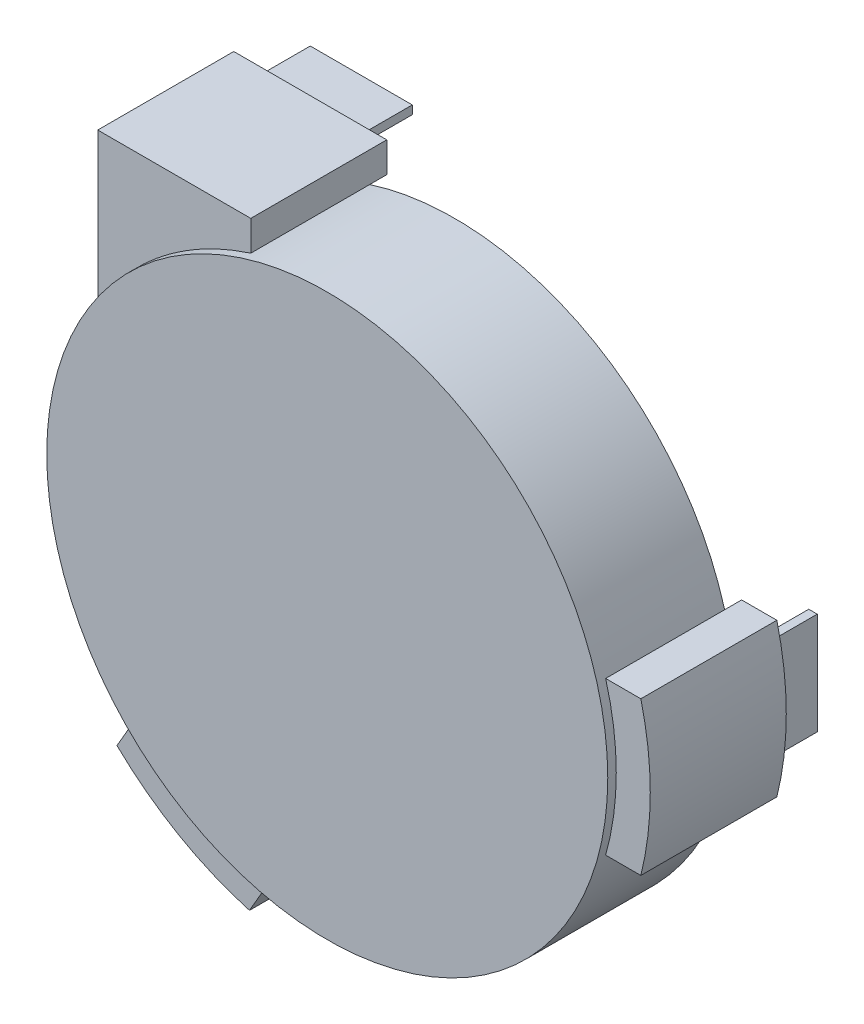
ISO-10303-21;
HEADER;
FILE_DESCRIPTION(('STEP AP214'),'2;1');
FILE_NAME('part.step','',(''),(''),'','','');
FILE_SCHEMA(('AUTOMOTIVE_DESIGN { 1 0 10303 214 1 1 1 1 }'));
ENDSEC;
DATA;
#1=APPLICATION_CONTEXT('core data for automotive mechanical design processes');
#2=APPLICATION_PROTOCOL_DEFINITION('international standard','automotive_design',2000,#1);
#3=PRODUCT_CONTEXT('',#1,'mechanical');
#4=PRODUCT('Part','Part','',(#3));
#5=PRODUCT_RELATED_PRODUCT_CATEGORY('part','',(#4));
#6=PRODUCT_DEFINITION_FORMATION('','',#4);
#7=PRODUCT_DEFINITION_CONTEXT('part definition',#1,'design');
#8=PRODUCT_DEFINITION('design','',#6,#7);
#9=PRODUCT_DEFINITION_SHAPE('','',#8);
#10=(LENGTH_UNIT() NAMED_UNIT(*) SI_UNIT(.MILLI.,.METRE.));
#11=(NAMED_UNIT(*) PLANE_ANGLE_UNIT() SI_UNIT($,.RADIAN.));
#12=(NAMED_UNIT(*) SI_UNIT($,.STERADIAN.) SOLID_ANGLE_UNIT());
#13=UNCERTAINTY_MEASURE_WITH_UNIT(LENGTH_MEASURE(1.E-05),#10,'distance_accuracy_value','');
#14=(GEOMETRIC_REPRESENTATION_CONTEXT(3) GLOBAL_UNCERTAINTY_ASSIGNED_CONTEXT((#13)) GLOBAL_UNIT_ASSIGNED_CONTEXT((#10,
#11,#12)) REPRESENTATION_CONTEXT('',''));
#15=CARTESIAN_POINT('',(0.,0.,0.));
#16=DIRECTION('',(0.,0.,1.));
#17=DIRECTION('',(1.,0.,0.));
#18=AXIS2_PLACEMENT_3D('',#15,#16,#17);
#19=CARTESIAN_POINT('',(-11.8343682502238,-11.4977270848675,-1.));
#20=DIRECTION('',(-0.866025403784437,0.500000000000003,0.));
#21=DIRECTION('',(-0.500000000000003,-0.866025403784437,0.));
#22=AXIS2_PLACEMENT_3D('',#19,#20,#21);
#23=PLANE('',#22);
#24=DIRECTION('',(-0.500000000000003,-0.866025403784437,0.));
#25=VECTOR('',#24,1.);
#26=CARTESIAN_POINT('',(-11.8343682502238,-11.4977270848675,7.));
#27=LINE('',#26,#25);
#28=CARTESIAN_POINT('',(-11.8343682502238,-11.4977270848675,7.));
#29=VERTEX_POINT('',#28);
#30=CARTESIAN_POINT('',(-12.8692935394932,-13.29027026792,7.));
#31=VERTEX_POINT('',#30);
#32=EDGE_CURVE('E12',#29,#31,#27,.T.);
#33=ORIENTED_EDGE('',*,*,#32,.F.);
#34=DIRECTION('',(0.,0.,1.));
#35=VECTOR('',#34,1.);
#36=CARTESIAN_POINT('',(-11.8343682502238,-11.4977270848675,-1.));
#37=LINE('',#36,#35);
#38=CARTESIAN_POINT('',(-11.8343682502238,-11.4977270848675,-1.));
#39=VERTEX_POINT('',#38);
#40=EDGE_CURVE('E99',#39,#29,#37,.T.);
#41=ORIENTED_EDGE('',*,*,#40,.F.);
#42=DIRECTION('',(-0.500000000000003,-0.866025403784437,0.));
#43=VECTOR('',#42,1.);
#44=CARTESIAN_POINT('',(-11.8343682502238,-11.4977270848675,-1.));
#45=LINE('',#44,#43);
#46=CARTESIAN_POINT('',(-12.8692935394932,-13.29027026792,-1.));
#47=VERTEX_POINT('',#46);
#48=EDGE_CURVE('E51',#39,#47,#45,.T.);
#49=ORIENTED_EDGE('',*,*,#48,.T.);
#50=DIRECTION('',(0.,0.,1.));
#51=VECTOR('',#50,1.);
#52=CARTESIAN_POINT('',(-12.8692935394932,-13.29027026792,-1.));
#53=LINE('',#52,#51);
#54=EDGE_CURVE('E73',#47,#31,#53,.T.);
#55=ORIENTED_EDGE('',*,*,#54,.T.);
#56=EDGE_LOOP('',(#33,#41,#49,#55));
#57=FACE_BOUND('',#56,.T.);
#58=ADVANCED_FACE('F47',(#57),#23,.T.);
#59=CARTESIAN_POINT('',(0.,0.,-1.));
#60=DIRECTION('',(0.,0.,1.));
#61=DIRECTION('',(1.,0.,0.));
#62=AXIS2_PLACEMENT_3D('',#59,#60,#61);
#63=CYLINDRICAL_SURFACE('',#62,16.5);
#64=CARTESIAN_POINT('',(0.,0.,7.));
#65=DIRECTION('',(0.,0.,1.));
#66=DIRECTION('',(1.,0.,0.));
#67=AXIS2_PLACEMENT_3D('',#64,#65,#66);
#68=CIRCLE('',#67,16.5);
#69=CARTESIAN_POINT('',(-4.04013961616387,-15.9977270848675,7.));
#70=VERTEX_POINT('',#69);
#71=EDGE_CURVE('E166',#29,#70,#68,.T.);
#72=ORIENTED_EDGE('',*,*,#71,.T.);
#73=DIRECTION('',(0.,0.,1.));
#74=VECTOR('',#73,1.);
#75=CARTESIAN_POINT('',(-4.04013961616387,-15.9977270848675,-1.));
#76=LINE('',#75,#74);
#77=CARTESIAN_POINT('',(-4.04013961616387,-15.9977270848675,-1.));
#78=VERTEX_POINT('',#77);
#79=EDGE_CURVE('E162',#78,#70,#76,.T.);
#80=ORIENTED_EDGE('',*,*,#79,.F.);
#81=CARTESIAN_POINT('',(0.,0.,-1.));
#82=DIRECTION('',(0.,0.,1.));
#83=DIRECTION('',(1.,0.,0.));
#84=AXIS2_PLACEMENT_3D('',#81,#82,#83);
#85=CIRCLE('',#84,16.5);
#86=EDGE_CURVE('E159',#39,#78,#85,.T.);
#87=ORIENTED_EDGE('',*,*,#86,.F.);
#88=ORIENTED_EDGE('',*,*,#40,.T.);
#89=EDGE_LOOP('',(#72,#80,#87,#88));
#90=FACE_BOUND('',#89,.T.);
#91=ADVANCED_FACE('F186',(#90),#63,.F.);
#92=CARTESIAN_POINT('',(-4.04013961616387,-15.9977270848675,-1.));
#93=DIRECTION('',(-0.866025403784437,0.500000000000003,0.));
#94=DIRECTION('',(-0.500000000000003,-0.866025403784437,0.));
#95=AXIS2_PLACEMENT_3D('',#92,#93,#94);
#96=PLANE('',#95);
#97=DIRECTION('',(-0.500000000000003,-0.866025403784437,0.));
#98=VECTOR('',#97,1.);
#99=CARTESIAN_POINT('',(-4.04013961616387,-15.9977270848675,7.));
#100=LINE('',#99,#98);
#101=CARTESIAN_POINT('',(-5.07506490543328,-17.79027026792,7.));
#102=VERTEX_POINT('',#101);
#103=EDGE_CURVE('E168',#70,#102,#100,.T.);
#104=ORIENTED_EDGE('',*,*,#103,.T.);
#105=DIRECTION('',(0.,0.,1.));
#106=VECTOR('',#105,1.);
#107=CARTESIAN_POINT('',(-5.07506490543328,-17.79027026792,-1.));
#108=LINE('',#107,#106);
#109=CARTESIAN_POINT('',(-5.07506490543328,-17.79027026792,-1.));
#110=VERTEX_POINT('',#109);
#111=EDGE_CURVE('E160',#110,#102,#108,.T.);
#112=ORIENTED_EDGE('',*,*,#111,.F.);
#113=DIRECTION('',(-0.500000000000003,-0.866025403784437,0.));
#114=VECTOR('',#113,1.);
#115=CARTESIAN_POINT('',(-4.04013961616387,-15.9977270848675,-1.));
#116=LINE('',#115,#114);
#117=EDGE_CURVE('E174',#78,#110,#116,.T.);
#118=ORIENTED_EDGE('',*,*,#117,.F.);
#119=ORIENTED_EDGE('',*,*,#79,.T.);
#120=EDGE_LOOP('',(#104,#112,#118,#119));
#121=FACE_BOUND('',#120,.T.);
#122=ADVANCED_FACE('F181',(#121),#96,.F.);
#123=CARTESIAN_POINT('',(0.,0.,-1.));
#124=DIRECTION('',(0.,0.,1.));
#125=DIRECTION('',(1.,0.,0.));
#126=AXIS2_PLACEMENT_3D('',#123,#124,#125);
#127=CYLINDRICAL_SURFACE('',#126,18.5);
#128=CARTESIAN_POINT('',(0.,0.,7.));
#129=DIRECTION('',(0.,0.,1.));
#130=DIRECTION('',(1.,0.,0.));
#131=AXIS2_PLACEMENT_3D('',#128,#129,#130);
#132=CIRCLE('',#131,18.5);
#133=EDGE_CURVE('E56',#31,#102,#132,.T.);
#134=ORIENTED_EDGE('',*,*,#133,.F.);
#135=ORIENTED_EDGE('',*,*,#54,.F.);
#136=CARTESIAN_POINT('',(0.,0.,-1.));
#137=DIRECTION('',(0.,0.,1.));
#138=DIRECTION('',(1.,0.,0.));
#139=AXIS2_PLACEMENT_3D('',#136,#137,#138);
#140=CIRCLE('',#139,18.5);
#141=EDGE_CURVE('E175',#47,#110,#140,.T.);
#142=ORIENTED_EDGE('',*,*,#141,.T.);
#143=ORIENTED_EDGE('',*,*,#111,.T.);
#144=EDGE_LOOP('',(#134,#135,#142,#143));
#145=FACE_BOUND('',#144,.T.);
#146=ADVANCED_FACE('F183',(#145),#127,.T.);
#147=CARTESIAN_POINT('',(0.,0.,-1.));
#148=DIRECTION('',(0.,0.,1.));
#149=DIRECTION('',(1.,0.,0.));
#150=AXIS2_PLACEMENT_3D('',#147,#148,#149);
#151=PLANE('',#150);
#152=DIRECTION('',(-0.866025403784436,0.500000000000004,0.));
#153=VECTOR('',#152,1.);
#154=CARTESIAN_POINT('',(-6.06274069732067,-16.5009749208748,-1.));
#155=LINE('',#154,#153);
#156=CARTESIAN_POINT('',(-6.06274069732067,-16.5009749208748,-1.));
#157=VERTEX_POINT('',#156);
#158=CARTESIAN_POINT('',(-11.2588931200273,-13.5009749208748,-1.));
#159=VERTEX_POINT('',#158);
#160=EDGE_CURVE('E128',#157,#159,#155,.T.);
#161=ORIENTED_EDGE('',*,*,#160,.F.);
#162=DIRECTION('',(0.500000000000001,0.866025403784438,0.));
#163=VECTOR('',#162,1.);
#164=CARTESIAN_POINT('',(-6.06274069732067,-16.5009749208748,-1.));
#165=LINE('',#164,#163);
#166=CARTESIAN_POINT('',(-5.81274069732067,-16.0679622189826,-1.));
#167=VERTEX_POINT('',#166);
#168=EDGE_CURVE('E136',#157,#167,#165,.T.);
#169=ORIENTED_EDGE('',*,*,#168,.T.);
#170=DIRECTION('',(-0.866025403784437,0.500000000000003,0.));
#171=VECTOR('',#170,1.);
#172=CARTESIAN_POINT('',(-5.81274069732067,-16.0679622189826,-1.));
#173=LINE('',#172,#171);
#174=CARTESIAN_POINT('',(-11.0088931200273,-13.0679622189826,-1.));
#175=VERTEX_POINT('',#174);
#176=EDGE_CURVE('E142',#167,#175,#173,.T.);
#177=ORIENTED_EDGE('',*,*,#176,.T.);
#178=DIRECTION('',(0.500000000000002,0.866025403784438,0.));
#179=VECTOR('',#178,1.);
#180=CARTESIAN_POINT('',(-11.2588931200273,-13.5009749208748,-1.));
#181=LINE('',#180,#179);
#182=EDGE_CURVE('E64',#159,#175,#181,.T.);
#183=ORIENTED_EDGE('',*,*,#182,.F.);
#184=EDGE_LOOP('',(#161,#169,#177,#183));
#185=FACE_BOUND('',#184,.T.);
#186=ORIENTED_EDGE('',*,*,#48,.F.);
#187=ORIENTED_EDGE('',*,*,#86,.T.);
#188=ORIENTED_EDGE('',*,*,#117,.T.);
#189=ORIENTED_EDGE('',*,*,#141,.F.);
#190=EDGE_LOOP('',(#186,#187,#188,#189));
#191=FACE_BOUND('',#190,.T.);
#192=ADVANCED_FACE('F49',(#185,#191),#151,.F.);
#193=CARTESIAN_POINT('',(0.,0.,7.));
#194=DIRECTION('',(0.,0.,1.));
#195=DIRECTION('',(1.,0.,0.));
#196=AXIS2_PLACEMENT_3D('',#193,#194,#195);
#197=PLANE('',#196);
#198=ORIENTED_EDGE('',*,*,#32,.T.);
#199=ORIENTED_EDGE('',*,*,#133,.T.);
#200=ORIENTED_EDGE('',*,*,#103,.F.);
#201=ORIENTED_EDGE('',*,*,#71,.F.);
#202=EDGE_LOOP('',(#198,#199,#200,#201));
#203=FACE_BOUND('',#202,.T.);
#204=ADVANCED_FACE('F185',(#203),#197,.T.);
#205=CARTESIAN_POINT('',(-6.06274069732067,-16.5009749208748,-4.));
#206=DIRECTION('',(0.866025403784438,-0.500000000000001,0.));
#207=DIRECTION('',(0.500000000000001,0.866025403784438,0.));
#208=AXIS2_PLACEMENT_3D('',#205,#206,#207);
#209=PLANE('',#208);
#210=ORIENTED_EDGE('',*,*,#168,.F.);
#211=DIRECTION('',(0.,0.,1.));
#212=VECTOR('',#211,1.);
#213=CARTESIAN_POINT('',(-6.06274069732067,-16.5009749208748,-4.));
#214=LINE('',#213,#212);
#215=CARTESIAN_POINT('',(-6.06274069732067,-16.5009749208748,-4.));
#216=VERTEX_POINT('',#215);
#217=EDGE_CURVE('E123',#216,#157,#214,.T.);
#218=ORIENTED_EDGE('',*,*,#217,.F.);
#219=DIRECTION('',(0.500000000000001,0.866025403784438,0.));
#220=VECTOR('',#219,1.);
#221=CARTESIAN_POINT('',(-6.06274069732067,-16.5009749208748,-4.));
#222=LINE('',#221,#220);
#223=CARTESIAN_POINT('',(-5.81274069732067,-16.0679622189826,-4.));
#224=VERTEX_POINT('',#223);
#225=EDGE_CURVE('E145',#216,#224,#222,.T.);
#226=ORIENTED_EDGE('',*,*,#225,.T.);
#227=DIRECTION('',(0.,0.,1.));
#228=VECTOR('',#227,1.);
#229=CARTESIAN_POINT('',(-5.81274069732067,-16.0679622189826,-4.));
#230=LINE('',#229,#228);
#231=EDGE_CURVE('E138',#224,#167,#230,.T.);
#232=ORIENTED_EDGE('',*,*,#231,.T.);
#233=EDGE_LOOP('',(#210,#218,#226,#232));
#234=FACE_BOUND('',#233,.T.);
#235=ADVANCED_FACE('F137',(#234),#209,.T.);
#236=CARTESIAN_POINT('',(-6.06274069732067,-16.5009749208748,-4.));
#237=DIRECTION('',(0.500000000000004,0.866025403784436,0.));
#238=DIRECTION('',(-0.866025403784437,0.500000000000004,0.));
#239=AXIS2_PLACEMENT_3D('',#236,#237,#238);
#240=PLANE('',#239);
#241=ORIENTED_EDGE('',*,*,#160,.T.);
#242=DIRECTION('',(0.,0.,1.));
#243=VECTOR('',#242,1.);
#244=CARTESIAN_POINT('',(-11.2588931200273,-13.5009749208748,-4.));
#245=LINE('',#244,#243);
#246=CARTESIAN_POINT('',(-11.2588931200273,-13.5009749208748,-4.));
#247=VERTEX_POINT('',#246);
#248=EDGE_CURVE('E133',#247,#159,#245,.T.);
#249=ORIENTED_EDGE('',*,*,#248,.F.);
#250=DIRECTION('',(-0.866025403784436,0.500000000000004,0.));
#251=VECTOR('',#250,1.);
#252=CARTESIAN_POINT('',(-6.06274069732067,-16.5009749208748,-4.));
#253=LINE('',#252,#251);
#254=EDGE_CURVE('E129',#216,#247,#253,.T.);
#255=ORIENTED_EDGE('',*,*,#254,.F.);
#256=ORIENTED_EDGE('',*,*,#217,.T.);
#257=EDGE_LOOP('',(#241,#249,#255,#256));
#258=FACE_BOUND('',#257,.T.);
#259=ADVANCED_FACE('F125',(#258),#240,.F.);
#260=CARTESIAN_POINT('',(-11.2588931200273,-13.5009749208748,-4.));
#261=DIRECTION('',(0.866025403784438,-0.500000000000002,0.));
#262=DIRECTION('',(0.500000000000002,0.866025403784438,0.));
#263=AXIS2_PLACEMENT_3D('',#260,#261,#262);
#264=PLANE('',#263);
#265=ORIENTED_EDGE('',*,*,#182,.T.);
#266=DIRECTION('',(0.,0.,1.));
#267=VECTOR('',#266,1.);
#268=CARTESIAN_POINT('',(-11.0088931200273,-13.0679622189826,-4.));
#269=LINE('',#268,#267);
#270=CARTESIAN_POINT('',(-11.0088931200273,-13.0679622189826,-4.));
#271=VERTEX_POINT('',#270);
#272=EDGE_CURVE('E223',#271,#175,#269,.T.);
#273=ORIENTED_EDGE('',*,*,#272,.F.);
#274=DIRECTION('',(0.500000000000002,0.866025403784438,0.));
#275=VECTOR('',#274,1.);
#276=CARTESIAN_POINT('',(-11.2588931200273,-13.5009749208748,-4.));
#277=LINE('',#276,#275);
#278=EDGE_CURVE('E154',#247,#271,#277,.T.);
#279=ORIENTED_EDGE('',*,*,#278,.F.);
#280=ORIENTED_EDGE('',*,*,#248,.T.);
#281=EDGE_LOOP('',(#265,#273,#279,#280));
#282=FACE_BOUND('',#281,.T.);
#283=ADVANCED_FACE('F215',(#282),#264,.F.);
#284=CARTESIAN_POINT('',(-5.81274069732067,-16.0679622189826,-4.));
#285=DIRECTION('',(0.500000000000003,0.866025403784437,0.));
#286=DIRECTION('',(-0.866025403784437,0.500000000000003,0.));
#287=AXIS2_PLACEMENT_3D('',#284,#285,#286);
#288=PLANE('',#287);
#289=ORIENTED_EDGE('',*,*,#176,.F.);
#290=ORIENTED_EDGE('',*,*,#231,.F.);
#291=DIRECTION('',(-0.866025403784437,0.500000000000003,0.));
#292=VECTOR('',#291,1.);
#293=CARTESIAN_POINT('',(-5.81274069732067,-16.0679622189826,-4.));
#294=LINE('',#293,#292);
#295=EDGE_CURVE('E148',#224,#271,#294,.T.);
#296=ORIENTED_EDGE('',*,*,#295,.T.);
#297=ORIENTED_EDGE('',*,*,#272,.T.);
#298=EDGE_LOOP('',(#289,#290,#296,#297));
#299=FACE_BOUND('',#298,.T.);
#300=ADVANCED_FACE('F211',(#299),#288,.T.);
#301=CARTESIAN_POINT('',(-5.81274069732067,-16.0679622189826,-4.));
#302=DIRECTION('',(0.,0.,1.));
#303=DIRECTION('',(1.,0.,0.));
#304=AXIS2_PLACEMENT_3D('',#301,#302,#303);
#305=PLANE('',#304);
#306=ORIENTED_EDGE('',*,*,#225,.F.);
#307=ORIENTED_EDGE('',*,*,#254,.T.);
#308=ORIENTED_EDGE('',*,*,#278,.T.);
#309=ORIENTED_EDGE('',*,*,#295,.F.);
#310=EDGE_LOOP('',(#306,#307,#308,#309));
#311=FACE_BOUND('',#310,.T.);
#312=ADVANCED_FACE('F208',(#311),#305,.F.);
#313=CLOSED_SHELL('',(#58,#91,#122,#146,#192,#204,#235,#259,#283,#300,#312));
#314=MANIFOLD_SOLID_BREP('B2',#313);
#315=CARTESIAN_POINT('',(15.8745078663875,-4.5,-1.));
#316=DIRECTION('',(0.,-1.,0.));
#317=DIRECTION('',(0.,0.,-1.));
#318=AXIS2_PLACEMENT_3D('',#315,#316,#317);
#319=PLANE('',#318);
#320=DIRECTION('',(1.,0.,0.));
#321=VECTOR('',#320,1.);
#322=CARTESIAN_POINT('',(15.8745078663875,-4.5,7.));
#323=LINE('',#322,#321);
#324=CARTESIAN_POINT('',(15.8745078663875,-4.50000000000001,7.));
#325=VERTEX_POINT('',#324);
#326=CARTESIAN_POINT('',(17.9443584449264,-4.50000000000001,7.));
#327=VERTEX_POINT('',#326);
#328=EDGE_CURVE('E45',#325,#327,#323,.T.);
#329=ORIENTED_EDGE('',*,*,#328,.F.);
#330=DIRECTION('',(0.,0.,1.));
#331=VECTOR('',#330,1.);
#332=CARTESIAN_POINT('',(15.8745078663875,-4.50000000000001,-1.));
#333=LINE('',#332,#331);
#334=CARTESIAN_POINT('',(15.8745078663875,-4.50000000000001,-1.));
#335=VERTEX_POINT('',#334);
#336=EDGE_CURVE('E347',#335,#325,#333,.T.);
#337=ORIENTED_EDGE('',*,*,#336,.F.);
#338=DIRECTION('',(1.,0.,0.));
#339=VECTOR('',#338,1.);
#340=CARTESIAN_POINT('',(15.8745078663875,-4.5,-1.));
#341=LINE('',#340,#339);
#342=CARTESIAN_POINT('',(17.9443584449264,-4.50000000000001,-1.));
#343=VERTEX_POINT('',#342);
#344=EDGE_CURVE('E299',#335,#343,#341,.T.);
#345=ORIENTED_EDGE('',*,*,#344,.T.);
#346=DIRECTION('',(0.,0.,1.));
#347=VECTOR('',#346,1.);
#348=CARTESIAN_POINT('',(17.9443584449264,-4.50000000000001,-1.));
#349=LINE('',#348,#347);
#350=EDGE_CURVE('E321',#343,#327,#349,.T.);
#351=ORIENTED_EDGE('',*,*,#350,.T.);
#352=EDGE_LOOP('',(#329,#337,#345,#351));
#353=FACE_BOUND('',#352,.T.);
#354=ADVANCED_FACE('F295',(#353),#319,.T.);
#355=CARTESIAN_POINT('',(0.,0.,-1.));
#356=DIRECTION('',(0.,0.,1.));
#357=DIRECTION('',(1.,0.,0.));
#358=AXIS2_PLACEMENT_3D('',#355,#356,#357);
#359=CYLINDRICAL_SURFACE('',#358,16.5);
#360=CARTESIAN_POINT('',(0.,0.,7.));
#361=DIRECTION('',(0.,0.,1.));
#362=DIRECTION('',(1.,0.,0.));
#363=AXIS2_PLACEMENT_3D('',#360,#361,#362);
#364=CIRCLE('',#363,16.5);
#365=CARTESIAN_POINT('',(15.8745078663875,4.50000000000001,7.));
#366=VERTEX_POINT('',#365);
#367=EDGE_CURVE('E414',#325,#366,#364,.T.);
#368=ORIENTED_EDGE('',*,*,#367,.T.);
#369=DIRECTION('',(0.,0.,1.));
#370=VECTOR('',#369,1.);
#371=CARTESIAN_POINT('',(15.8745078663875,4.50000000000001,-1.));
#372=LINE('',#371,#370);
#373=CARTESIAN_POINT('',(15.8745078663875,4.50000000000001,-1.));
#374=VERTEX_POINT('',#373);
#375=EDGE_CURVE('E410',#374,#366,#372,.T.);
#376=ORIENTED_EDGE('',*,*,#375,.F.);
#377=CARTESIAN_POINT('',(0.,0.,-1.));
#378=DIRECTION('',(0.,0.,1.));
#379=DIRECTION('',(1.,0.,0.));
#380=AXIS2_PLACEMENT_3D('',#377,#378,#379);
#381=CIRCLE('',#380,16.5);
#382=EDGE_CURVE('E407',#335,#374,#381,.T.);
#383=ORIENTED_EDGE('',*,*,#382,.F.);
#384=ORIENTED_EDGE('',*,*,#336,.T.);
#385=EDGE_LOOP('',(#368,#376,#383,#384));
#386=FACE_BOUND('',#385,.T.);
#387=ADVANCED_FACE('F434',(#386),#359,.F.);
#388=CARTESIAN_POINT('',(15.8745078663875,4.5,-1.));
#389=DIRECTION('',(0.,-1.,0.));
#390=DIRECTION('',(0.,0.,-1.));
#391=AXIS2_PLACEMENT_3D('',#388,#389,#390);
#392=PLANE('',#391);
#393=DIRECTION('',(1.,0.,0.));
#394=VECTOR('',#393,1.);
#395=CARTESIAN_POINT('',(15.8745078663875,4.5,7.));
#396=LINE('',#395,#394);
#397=CARTESIAN_POINT('',(17.9443584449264,4.5,7.));
#398=VERTEX_POINT('',#397);
#399=EDGE_CURVE('E416',#366,#398,#396,.T.);
#400=ORIENTED_EDGE('',*,*,#399,.T.);
#401=DIRECTION('',(0.,0.,1.));
#402=VECTOR('',#401,1.);
#403=CARTESIAN_POINT('',(17.9443584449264,4.5,-1.));
#404=LINE('',#403,#402);
#405=CARTESIAN_POINT('',(17.9443584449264,4.5,-1.));
#406=VERTEX_POINT('',#405);
#407=EDGE_CURVE('E408',#406,#398,#404,.T.);
#408=ORIENTED_EDGE('',*,*,#407,.F.);
#409=DIRECTION('',(1.,0.,0.));
#410=VECTOR('',#409,1.);
#411=CARTESIAN_POINT('',(15.8745078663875,4.5,-1.));
#412=LINE('',#411,#410);
#413=EDGE_CURVE('E422',#374,#406,#412,.T.);
#414=ORIENTED_EDGE('',*,*,#413,.F.);
#415=ORIENTED_EDGE('',*,*,#375,.T.);
#416=EDGE_LOOP('',(#400,#408,#414,#415));
#417=FACE_BOUND('',#416,.T.);
#418=ADVANCED_FACE('F429',(#417),#392,.F.);
#419=CARTESIAN_POINT('',(0.,0.,-1.));
#420=DIRECTION('',(0.,0.,1.));
#421=DIRECTION('',(1.,0.,0.));
#422=AXIS2_PLACEMENT_3D('',#419,#420,#421);
#423=CYLINDRICAL_SURFACE('',#422,18.5);
#424=CARTESIAN_POINT('',(0.,0.,7.));
#425=DIRECTION('',(0.,0.,1.));
#426=DIRECTION('',(1.,0.,0.));
#427=AXIS2_PLACEMENT_3D('',#424,#425,#426);
#428=CIRCLE('',#427,18.5);
#429=EDGE_CURVE('E304',#327,#398,#428,.T.);
#430=ORIENTED_EDGE('',*,*,#429,.F.);
#431=ORIENTED_EDGE('',*,*,#350,.F.);
#432=CARTESIAN_POINT('',(0.,0.,-1.));
#433=DIRECTION('',(0.,0.,1.));
#434=DIRECTION('',(1.,0.,0.));
#435=AXIS2_PLACEMENT_3D('',#432,#433,#434);
#436=CIRCLE('',#435,18.5);
#437=EDGE_CURVE('E423',#343,#406,#436,.T.);
#438=ORIENTED_EDGE('',*,*,#437,.T.);
#439=ORIENTED_EDGE('',*,*,#407,.T.);
#440=EDGE_LOOP('',(#430,#431,#438,#439));
#441=FACE_BOUND('',#440,.T.);
#442=ADVANCED_FACE('F431',(#441),#423,.T.);
#443=CARTESIAN_POINT('',(0.,0.,-1.));
#444=DIRECTION('',(0.,0.,1.));
#445=DIRECTION('',(1.,0.,0.));
#446=AXIS2_PLACEMENT_3D('',#443,#444,#445);
#447=PLANE('',#446);
#448=DIRECTION('',(0.,-1.,0.));
#449=VECTOR('',#448,1.);
#450=CARTESIAN_POINT('',(17.3216338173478,3.,-1.));
#451=LINE('',#450,#449);
#452=CARTESIAN_POINT('',(17.3216338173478,3.,-1.));
#453=VERTEX_POINT('',#452);
#454=CARTESIAN_POINT('',(17.3216338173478,-3.,-1.));
#455=VERTEX_POINT('',#454);
#456=EDGE_CURVE('E376',#453,#455,#451,.T.);
#457=ORIENTED_EDGE('',*,*,#456,.F.);
#458=DIRECTION('',(-1.,0.,0.));
#459=VECTOR('',#458,1.);
#460=CARTESIAN_POINT('',(17.3216338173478,3.,-1.));
#461=LINE('',#460,#459);
#462=CARTESIAN_POINT('',(16.8216338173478,3.,-1.));
#463=VERTEX_POINT('',#462);
#464=EDGE_CURVE('E384',#453,#463,#461,.T.);
#465=ORIENTED_EDGE('',*,*,#464,.T.);
#466=DIRECTION('',(0.,-1.,0.));
#467=VECTOR('',#466,1.);
#468=CARTESIAN_POINT('',(16.8216338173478,3.,-1.));
#469=LINE('',#468,#467);
#470=CARTESIAN_POINT('',(16.8216338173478,-3.,-1.));
#471=VERTEX_POINT('',#470);
#472=EDGE_CURVE('E390',#463,#471,#469,.T.);
#473=ORIENTED_EDGE('',*,*,#472,.T.);
#474=DIRECTION('',(-1.,0.,0.));
#475=VECTOR('',#474,1.);
#476=CARTESIAN_POINT('',(17.3216338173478,-3.,-1.));
#477=LINE('',#476,#475);
#478=EDGE_CURVE('E312',#455,#471,#477,.T.);
#479=ORIENTED_EDGE('',*,*,#478,.F.);
#480=EDGE_LOOP('',(#457,#465,#473,#479));
#481=FACE_BOUND('',#480,.T.);
#482=ORIENTED_EDGE('',*,*,#344,.F.);
#483=ORIENTED_EDGE('',*,*,#382,.T.);
#484=ORIENTED_EDGE('',*,*,#413,.T.);
#485=ORIENTED_EDGE('',*,*,#437,.F.);
#486=EDGE_LOOP('',(#482,#483,#484,#485));
#487=FACE_BOUND('',#486,.T.);
#488=ADVANCED_FACE('F297',(#481,#487),#447,.F.);
#489=CARTESIAN_POINT('',(0.,0.,7.));
#490=DIRECTION('',(0.,0.,1.));
#491=DIRECTION('',(1.,0.,0.));
#492=AXIS2_PLACEMENT_3D('',#489,#490,#491);
#493=PLANE('',#492);
#494=ORIENTED_EDGE('',*,*,#328,.T.);
#495=ORIENTED_EDGE('',*,*,#429,.T.);
#496=ORIENTED_EDGE('',*,*,#399,.F.);
#497=ORIENTED_EDGE('',*,*,#367,.F.);
#498=EDGE_LOOP('',(#494,#495,#496,#497));
#499=FACE_BOUND('',#498,.T.);
#500=ADVANCED_FACE('F433',(#499),#493,.T.);
#501=CARTESIAN_POINT('',(17.3216338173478,3.,-4.));
#502=DIRECTION('',(0.,1.,0.));
#503=DIRECTION('',(0.,0.,1.));
#504=AXIS2_PLACEMENT_3D('',#501,#502,#503);
#505=PLANE('',#504);
#506=ORIENTED_EDGE('',*,*,#464,.F.);
#507=DIRECTION('',(0.,0.,1.));
#508=VECTOR('',#507,1.);
#509=CARTESIAN_POINT('',(17.3216338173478,3.,-4.));
#510=LINE('',#509,#508);
#511=CARTESIAN_POINT('',(17.3216338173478,3.,-4.));
#512=VERTEX_POINT('',#511);
#513=EDGE_CURVE('E371',#512,#453,#510,.T.);
#514=ORIENTED_EDGE('',*,*,#513,.F.);
#515=DIRECTION('',(-1.,0.,0.));
#516=VECTOR('',#515,1.);
#517=CARTESIAN_POINT('',(17.3216338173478,3.,-4.));
#518=LINE('',#517,#516);
#519=CARTESIAN_POINT('',(16.8216338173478,3.,-4.));
#520=VERTEX_POINT('',#519);
#521=EDGE_CURVE('E393',#512,#520,#518,.T.);
#522=ORIENTED_EDGE('',*,*,#521,.T.);
#523=DIRECTION('',(0.,0.,1.));
#524=VECTOR('',#523,1.);
#525=CARTESIAN_POINT('',(16.8216338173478,3.,-4.));
#526=LINE('',#525,#524);
#527=EDGE_CURVE('E386',#520,#463,#526,.T.);
#528=ORIENTED_EDGE('',*,*,#527,.T.);
#529=EDGE_LOOP('',(#506,#514,#522,#528));
#530=FACE_BOUND('',#529,.T.);
#531=ADVANCED_FACE('F385',(#530),#505,.T.);
#532=CARTESIAN_POINT('',(17.3216338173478,3.,-4.));
#533=DIRECTION('',(-1.,0.,0.));
#534=DIRECTION('',(0.,0.,1.));
#535=AXIS2_PLACEMENT_3D('',#532,#533,#534);
#536=PLANE('',#535);
#537=ORIENTED_EDGE('',*,*,#456,.T.);
#538=DIRECTION('',(0.,0.,1.));
#539=VECTOR('',#538,1.);
#540=CARTESIAN_POINT('',(17.3216338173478,-3.,-4.));
#541=LINE('',#540,#539);
#542=CARTESIAN_POINT('',(17.3216338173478,-3.,-4.));
#543=VERTEX_POINT('',#542);
#544=EDGE_CURVE('E381',#543,#455,#541,.T.);
#545=ORIENTED_EDGE('',*,*,#544,.F.);
#546=DIRECTION('',(0.,-1.,0.));
#547=VECTOR('',#546,1.);
#548=CARTESIAN_POINT('',(17.3216338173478,3.,-4.));
#549=LINE('',#548,#547);
#550=EDGE_CURVE('E377',#512,#543,#549,.T.);
#551=ORIENTED_EDGE('',*,*,#550,.F.);
#552=ORIENTED_EDGE('',*,*,#513,.T.);
#553=EDGE_LOOP('',(#537,#545,#551,#552));
#554=FACE_BOUND('',#553,.T.);
#555=ADVANCED_FACE('F373',(#554),#536,.F.);
#556=CARTESIAN_POINT('',(17.3216338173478,-3.,-4.));
#557=DIRECTION('',(0.,1.,0.));
#558=DIRECTION('',(-1.,0.,0.));
#559=AXIS2_PLACEMENT_3D('',#556,#557,#558);
#560=PLANE('',#559);
#561=ORIENTED_EDGE('',*,*,#478,.T.);
#562=DIRECTION('',(0.,0.,1.));
#563=VECTOR('',#562,1.);
#564=CARTESIAN_POINT('',(16.8216338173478,-3.,-4.));
#565=LINE('',#564,#563);
#566=CARTESIAN_POINT('',(16.8216338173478,-3.,-4.));
#567=VERTEX_POINT('',#566);
#568=EDGE_CURVE('E471',#567,#471,#565,.T.);
#569=ORIENTED_EDGE('',*,*,#568,.F.);
#570=DIRECTION('',(-1.,0.,0.));
#571=VECTOR('',#570,1.);
#572=CARTESIAN_POINT('',(17.3216338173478,-3.,-4.));
#573=LINE('',#572,#571);
#574=EDGE_CURVE('E402',#543,#567,#573,.T.);
#575=ORIENTED_EDGE('',*,*,#574,.F.);
#576=ORIENTED_EDGE('',*,*,#544,.T.);
#577=EDGE_LOOP('',(#561,#569,#575,#576));
#578=FACE_BOUND('',#577,.T.);
#579=ADVANCED_FACE('F463',(#578),#560,.F.);
#580=CARTESIAN_POINT('',(16.8216338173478,3.,-4.));
#581=DIRECTION('',(-1.,0.,0.));
#582=DIRECTION('',(0.,0.,1.));
#583=AXIS2_PLACEMENT_3D('',#580,#581,#582);
#584=PLANE('',#583);
#585=ORIENTED_EDGE('',*,*,#472,.F.);
#586=ORIENTED_EDGE('',*,*,#527,.F.);
#587=DIRECTION('',(0.,-1.,0.));
#588=VECTOR('',#587,1.);
#589=CARTESIAN_POINT('',(16.8216338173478,3.,-4.));
#590=LINE('',#589,#588);
#591=EDGE_CURVE('E396',#520,#567,#590,.T.);
#592=ORIENTED_EDGE('',*,*,#591,.T.);
#593=ORIENTED_EDGE('',*,*,#568,.T.);
#594=EDGE_LOOP('',(#585,#586,#592,#593));
#595=FACE_BOUND('',#594,.T.);
#596=ADVANCED_FACE('F459',(#595),#584,.T.);
#597=CARTESIAN_POINT('',(16.8216338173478,3.,-4.));
#598=DIRECTION('',(0.,0.,1.));
#599=DIRECTION('',(1.,0.,0.));
#600=AXIS2_PLACEMENT_3D('',#597,#598,#599);
#601=PLANE('',#600);
#602=ORIENTED_EDGE('',*,*,#521,.F.);
#603=ORIENTED_EDGE('',*,*,#550,.T.);
#604=ORIENTED_EDGE('',*,*,#574,.T.);
#605=ORIENTED_EDGE('',*,*,#591,.F.);
#606=EDGE_LOOP('',(#602,#603,#604,#605));
#607=FACE_BOUND('',#606,.T.);
#608=ADVANCED_FACE('F456',(#607),#601,.F.);
#609=CLOSED_SHELL('',(#354,#387,#418,#442,#488,#500,#531,#555,#579,#596,#608));
#610=MANIFOLD_SOLID_BREP('B6',#609);
#611=CARTESIAN_POINT('',(0.,0.,-1.));
#612=DIRECTION('',(0.,0.,1.));
#613=DIRECTION('',(1.,0.,0.));
#614=AXIS2_PLACEMENT_3D('',#611,#612,#613);
#615=PLANE('',#614);
#616=DIRECTION('',(0.,1.,0.));
#617=VECTOR('',#616,1.);
#618=CARTESIAN_POINT('',(-4.99999999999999,15.7241851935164,-1.));
#619=LINE('',#618,#617);
#620=CARTESIAN_POINT('',(-4.99999999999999,15.7241851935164,-1.));
#621=VERTEX_POINT('',#620);
#622=CARTESIAN_POINT('',(-4.99999999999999,17.5,-1.));
#623=VERTEX_POINT('',#622);
#624=EDGE_CURVE('E651',#621,#623,#619,.T.);
#625=ORIENTED_EDGE('',*,*,#624,.F.);
#626=CARTESIAN_POINT('',(0.,0.,-1.));
#627=DIRECTION('',(0.,0.,1.));
#628=DIRECTION('',(1.,0.,0.));
#629=AXIS2_PLACEMENT_3D('',#626,#627,#628);
#630=CIRCLE('',#629,16.5);
#631=CARTESIAN_POINT('',(-14.,8.7321245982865,-1.));
#632=VERTEX_POINT('',#631);
#633=EDGE_CURVE('E658',#621,#632,#630,.T.);
#634=ORIENTED_EDGE('',*,*,#633,.T.);
#635=DIRECTION('',(0.,-1.,0.));
#636=VECTOR('',#635,1.);
#637=CARTESIAN_POINT('',(-14.,17.5,-1.));
#638=LINE('',#637,#636);
#639=CARTESIAN_POINT('',(-14.,17.5,-1.));
#640=VERTEX_POINT('',#639);
#641=EDGE_CURVE('E655',#640,#632,#638,.T.);
#642=ORIENTED_EDGE('',*,*,#641,.F.);
#643=DIRECTION('',(1.,0.,0.));
#644=VECTOR('',#643,1.);
#645=CARTESIAN_POINT('',(-14.,17.5,-1.));
#646=LINE('',#645,#644);
#647=EDGE_CURVE('E593',#640,#623,#646,.T.);
#648=ORIENTED_EDGE('',*,*,#647,.T.);
#649=EDGE_LOOP('',(#625,#634,#642,#648));
#650=FACE_BOUND('',#649,.T.);
#651=DIRECTION('',(0.,-1.,0.));
#652=VECTOR('',#651,1.);
#653=CARTESIAN_POINT('',(-6.5,17.0296768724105,-1.));
#654=LINE('',#653,#652);
#655=CARTESIAN_POINT('',(-6.5,17.0296768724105,-1.));
#656=VERTEX_POINT('',#655);
#657=CARTESIAN_POINT('',(-6.5,16.5296768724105,-1.));
#658=VERTEX_POINT('',#657);
#659=EDGE_CURVE('E640',#656,#658,#654,.T.);
#660=ORIENTED_EDGE('',*,*,#659,.F.);
#661=DIRECTION('',(-1.,0.,0.));
#662=VECTOR('',#661,1.);
#663=CARTESIAN_POINT('',(-6.5,17.0296768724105,-1.));
#664=LINE('',#663,#662);
#665=CARTESIAN_POINT('',(-12.5,17.0296768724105,-1.));
#666=VERTEX_POINT('',#665);
#667=EDGE_CURVE('E636',#656,#666,#664,.T.);
#668=ORIENTED_EDGE('',*,*,#667,.T.);
#669=DIRECTION('',(0.,-1.,0.));
#670=VECTOR('',#669,1.);
#671=CARTESIAN_POINT('',(-12.5,17.0296768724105,-1.));
#672=LINE('',#671,#670);
#673=CARTESIAN_POINT('',(-12.5,16.5296768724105,-1.));
#674=VERTEX_POINT('',#673);
#675=EDGE_CURVE('E559',#666,#674,#672,.T.);
#676=ORIENTED_EDGE('',*,*,#675,.T.);
#677=DIRECTION('',(-1.,0.,0.));
#678=VECTOR('',#677,1.);
#679=CARTESIAN_POINT('',(-6.5,16.5296768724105,-1.));
#680=LINE('',#679,#678);
#681=EDGE_CURVE('E682',#658,#674,#680,.T.);
#682=ORIENTED_EDGE('',*,*,#681,.F.);
#683=EDGE_LOOP('',(#660,#668,#676,#682));
#684=FACE_BOUND('',#683,.T.);
#685=ADVANCED_FACE('F542',(#650,#684),#615,.F.);
#686=CARTESIAN_POINT('',(-4.99999999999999,15.7241851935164,-1.));
#687=DIRECTION('',(1.,0.,0.));
#688=DIRECTION('',(0.,0.,-1.));
#689=AXIS2_PLACEMENT_3D('',#686,#687,#688);
#690=PLANE('',#689);
#691=DIRECTION('',(0.,1.,0.));
#692=VECTOR('',#691,1.);
#693=CARTESIAN_POINT('',(-4.99999999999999,15.7241851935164,7.));
#694=LINE('',#693,#692);
#695=CARTESIAN_POINT('',(-4.99999999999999,15.7241851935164,7.));
#696=VERTEX_POINT('',#695);
#697=CARTESIAN_POINT('',(-4.99999999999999,17.5,7.));
#698=VERTEX_POINT('',#697);
#699=EDGE_CURVE('E642',#696,#698,#694,.T.);
#700=ORIENTED_EDGE('',*,*,#699,.F.);
#701=DIRECTION('',(0.,0.,1.));
#702=VECTOR('',#701,1.);
#703=CARTESIAN_POINT('',(-4.99999999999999,15.7241851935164,-1.));
#704=LINE('',#703,#702);
#705=EDGE_CURVE('E293',#621,#696,#704,.T.);
#706=ORIENTED_EDGE('',*,*,#705,.F.);
#707=ORIENTED_EDGE('',*,*,#624,.T.);
#708=DIRECTION('',(0.,0.,1.));
#709=VECTOR('',#708,1.);
#710=CARTESIAN_POINT('',(-4.99999999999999,17.5,-1.));
#711=LINE('',#710,#709);
#712=EDGE_CURVE('E546',#623,#698,#711,.T.);
#713=ORIENTED_EDGE('',*,*,#712,.T.);
#714=EDGE_LOOP('',(#700,#706,#707,#713));
#715=FACE_BOUND('',#714,.T.);
#716=ADVANCED_FACE('F544',(#715),#690,.T.);
#717=CARTESIAN_POINT('',(0.,0.,-1.));
#718=DIRECTION('',(0.,0.,1.));
#719=DIRECTION('',(1.,0.,0.));
#720=AXIS2_PLACEMENT_3D('',#717,#718,#719);
#721=CYLINDRICAL_SURFACE('',#720,16.5);
#722=CARTESIAN_POINT('',(0.,0.,7.));
#723=DIRECTION('',(0.,0.,1.));
#724=DIRECTION('',(1.,0.,0.));
#725=AXIS2_PLACEMENT_3D('',#722,#723,#724);
#726=CIRCLE('',#725,16.5);
#727=CARTESIAN_POINT('',(-14.,8.7321245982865,7.));
#728=VERTEX_POINT('',#727);
#729=EDGE_CURVE('E653',#696,#728,#726,.T.);
#730=ORIENTED_EDGE('',*,*,#729,.T.);
#731=DIRECTION('',(0.,0.,1.));
#732=VECTOR('',#731,1.);
#733=CARTESIAN_POINT('',(-14.,8.7321245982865,-1.));
#734=LINE('',#733,#732);
#735=EDGE_CURVE('E551',#632,#728,#734,.T.);
#736=ORIENTED_EDGE('',*,*,#735,.F.);
#737=ORIENTED_EDGE('',*,*,#633,.F.);
#738=ORIENTED_EDGE('',*,*,#705,.T.);
#739=EDGE_LOOP('',(#730,#736,#737,#738));
#740=FACE_BOUND('',#739,.T.);
#741=ADVANCED_FACE('F674',(#740),#721,.F.);
#742=CARTESIAN_POINT('',(-14.,17.5,-1.));
#743=DIRECTION('',(-1.,0.,0.));
#744=DIRECTION('',(0.,-1.,0.));
#745=AXIS2_PLACEMENT_3D('',#742,#743,#744);
#746=PLANE('',#745);
#747=DIRECTION('',(0.,-1.,0.));
#748=VECTOR('',#747,1.);
#749=CARTESIAN_POINT('',(-14.,17.5,7.));
#750=LINE('',#749,#748);
#751=CARTESIAN_POINT('',(-14.,17.5,7.));
#752=VERTEX_POINT('',#751);
#753=EDGE_CURVE('E662',#752,#728,#750,.T.);
#754=ORIENTED_EDGE('',*,*,#753,.F.);
#755=DIRECTION('',(0.,0.,1.));
#756=VECTOR('',#755,1.);
#757=CARTESIAN_POINT('',(-14.,17.5,-1.));
#758=LINE('',#757,#756);
#759=EDGE_CURVE('E666',#640,#752,#758,.T.);
#760=ORIENTED_EDGE('',*,*,#759,.F.);
#761=ORIENTED_EDGE('',*,*,#641,.T.);
#762=ORIENTED_EDGE('',*,*,#735,.T.);
#763=EDGE_LOOP('',(#754,#760,#761,#762));
#764=FACE_BOUND('',#763,.T.);
#765=ADVANCED_FACE('F676',(#764),#746,.T.);
#766=CARTESIAN_POINT('',(-14.,17.5,-1.));
#767=DIRECTION('',(0.,-1.,0.));
#768=DIRECTION('',(0.,0.,-1.));
#769=AXIS2_PLACEMENT_3D('',#766,#767,#768);
#770=PLANE('',#769);
#771=DIRECTION('',(1.,0.,0.));
#772=VECTOR('',#771,1.);
#773=CARTESIAN_POINT('',(-14.,17.5,7.));
#774=LINE('',#773,#772);
#775=EDGE_CURVE('E645',#752,#698,#774,.T.);
#776=ORIENTED_EDGE('',*,*,#775,.T.);
#777=ORIENTED_EDGE('',*,*,#712,.F.);
#778=ORIENTED_EDGE('',*,*,#647,.F.);
#779=ORIENTED_EDGE('',*,*,#759,.T.);
#780=EDGE_LOOP('',(#776,#777,#778,#779));
#781=FACE_BOUND('',#780,.T.);
#782=ADVANCED_FACE('F669',(#781),#770,.F.);
#783=CARTESIAN_POINT('',(0.,0.,7.));
#784=DIRECTION('',(0.,0.,1.));
#785=DIRECTION('',(1.,0.,0.));
#786=AXIS2_PLACEMENT_3D('',#783,#784,#785);
#787=PLANE('',#786);
#788=ORIENTED_EDGE('',*,*,#699,.T.);
#789=ORIENTED_EDGE('',*,*,#775,.F.);
#790=ORIENTED_EDGE('',*,*,#753,.T.);
#791=ORIENTED_EDGE('',*,*,#729,.F.);
#792=EDGE_LOOP('',(#788,#789,#790,#791));
#793=FACE_BOUND('',#792,.T.);
#794=ADVANCED_FACE('F672',(#793),#787,.T.);
#795=CARTESIAN_POINT('',(-6.5,17.0296768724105,-4.));
#796=DIRECTION('',(-1.,0.,0.));
#797=DIRECTION('',(0.,0.,1.));
#798=AXIS2_PLACEMENT_3D('',#795,#796,#797);
#799=PLANE('',#798);
#800=ORIENTED_EDGE('',*,*,#659,.T.);
#801=DIRECTION('',(0.,0.,1.));
#802=VECTOR('',#801,1.);
#803=CARTESIAN_POINT('',(-6.5,16.5296768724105,-4.));
#804=LINE('',#803,#802);
#805=CARTESIAN_POINT('',(-6.5,16.5296768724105,-4.));
#806=VERTEX_POINT('',#805);
#807=EDGE_CURVE('E621',#806,#658,#804,.T.);
#808=ORIENTED_EDGE('',*,*,#807,.F.);
#809=DIRECTION('',(0.,-1.,0.));
#810=VECTOR('',#809,1.);
#811=CARTESIAN_POINT('',(-6.5,17.0296768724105,-4.));
#812=LINE('',#811,#810);
#813=CARTESIAN_POINT('',(-6.5,17.0296768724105,-4.));
#814=VERTEX_POINT('',#813);
#815=EDGE_CURVE('E628',#814,#806,#812,.T.);
#816=ORIENTED_EDGE('',*,*,#815,.F.);
#817=DIRECTION('',(0.,0.,1.));
#818=VECTOR('',#817,1.);
#819=CARTESIAN_POINT('',(-6.5,17.0296768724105,-4.));
#820=LINE('',#819,#818);
#821=EDGE_CURVE('E690',#814,#656,#820,.T.);
#822=ORIENTED_EDGE('',*,*,#821,.T.);
#823=EDGE_LOOP('',(#800,#808,#816,#822));
#824=FACE_BOUND('',#823,.T.);
#825=ADVANCED_FACE('F638',(#824),#799,.F.);
#826=CARTESIAN_POINT('',(-6.5,16.5296768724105,-4.));
#827=DIRECTION('',(0.,1.,0.));
#828=DIRECTION('',(0.,0.,1.));
#829=AXIS2_PLACEMENT_3D('',#826,#827,#828);
#830=PLANE('',#829);
#831=ORIENTED_EDGE('',*,*,#681,.T.);
#832=DIRECTION('',(0.,0.,1.));
#833=VECTOR('',#832,1.);
#834=CARTESIAN_POINT('',(-12.5,16.5296768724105,-4.));
#835=LINE('',#834,#833);
#836=CARTESIAN_POINT('',(-12.5,16.5296768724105,-4.));
#837=VERTEX_POINT('',#836);
#838=EDGE_CURVE('E623',#837,#674,#835,.T.);
#839=ORIENTED_EDGE('',*,*,#838,.F.);
#840=DIRECTION('',(-1.,0.,0.));
#841=VECTOR('',#840,1.);
#842=CARTESIAN_POINT('',(-6.5,16.5296768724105,-4.));
#843=LINE('',#842,#841);
#844=EDGE_CURVE('E616',#806,#837,#843,.T.);
#845=ORIENTED_EDGE('',*,*,#844,.F.);
#846=ORIENTED_EDGE('',*,*,#807,.T.);
#847=EDGE_LOOP('',(#831,#839,#845,#846));
#848=FACE_BOUND('',#847,.T.);
#849=ADVANCED_FACE('F619',(#848),#830,.F.);
#850=CARTESIAN_POINT('',(-12.5,17.0296768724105,-4.));
#851=DIRECTION('',(-1.,0.,0.));
#852=DIRECTION('',(0.,0.,1.));
#853=AXIS2_PLACEMENT_3D('',#850,#851,#852);
#854=PLANE('',#853);
#855=ORIENTED_EDGE('',*,*,#675,.F.);
#856=DIRECTION('',(0.,0.,1.));
#857=VECTOR('',#856,1.);
#858=CARTESIAN_POINT('',(-12.5,17.0296768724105,-4.));
#859=LINE('',#858,#857);
#860=CARTESIAN_POINT('',(-12.5,17.0296768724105,-4.));
#861=VERTEX_POINT('',#860);
#862=EDGE_CURVE('E647',#861,#666,#859,.T.);
#863=ORIENTED_EDGE('',*,*,#862,.F.);
#864=DIRECTION('',(0.,-1.,0.));
#865=VECTOR('',#864,1.);
#866=CARTESIAN_POINT('',(-12.5,17.0296768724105,-4.));
#867=LINE('',#866,#865);
#868=EDGE_CURVE('E627',#861,#837,#867,.T.);
#869=ORIENTED_EDGE('',*,*,#868,.T.);
#870=ORIENTED_EDGE('',*,*,#838,.T.);
#871=EDGE_LOOP('',(#855,#863,#869,#870));
#872=FACE_BOUND('',#871,.T.);
#873=ADVANCED_FACE('F693',(#872),#854,.T.);
#874=CARTESIAN_POINT('',(-6.5,17.0296768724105,-4.));
#875=DIRECTION('',(0.,1.,0.));
#876=DIRECTION('',(0.,0.,1.));
#877=AXIS2_PLACEMENT_3D('',#874,#875,#876);
#878=PLANE('',#877);
#879=ORIENTED_EDGE('',*,*,#667,.F.);
#880=ORIENTED_EDGE('',*,*,#821,.F.);
#881=DIRECTION('',(-1.,0.,0.));
#882=VECTOR('',#881,1.);
#883=CARTESIAN_POINT('',(-6.5,17.0296768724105,-4.));
#884=LINE('',#883,#882);
#885=EDGE_CURVE('E634',#814,#861,#884,.T.);
#886=ORIENTED_EDGE('',*,*,#885,.T.);
#887=ORIENTED_EDGE('',*,*,#862,.T.);
#888=EDGE_LOOP('',(#879,#880,#886,#887));
#889=FACE_BOUND('',#888,.T.);
#890=ADVANCED_FACE('F692',(#889),#878,.T.);
#891=CARTESIAN_POINT('',(-6.5,16.5296768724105,-4.));
#892=DIRECTION('',(0.,0.,-1.));
#893=DIRECTION('',(-1.,0.,0.));
#894=AXIS2_PLACEMENT_3D('',#891,#892,#893);
#895=PLANE('',#894);
#896=ORIENTED_EDGE('',*,*,#815,.T.);
#897=ORIENTED_EDGE('',*,*,#844,.T.);
#898=ORIENTED_EDGE('',*,*,#868,.F.);
#899=ORIENTED_EDGE('',*,*,#885,.F.);
#900=EDGE_LOOP('',(#896,#897,#898,#899));
#901=FACE_BOUND('',#900,.T.);
#902=ADVANCED_FACE('F632',(#901),#895,.T.);
#903=CLOSED_SHELL('',(#685,#716,#741,#765,#782,#794,#825,#849,#873,#890,#902));
#904=MANIFOLD_SOLID_BREP('B39',#903);
#905=CARTESIAN_POINT('',(0.,0.,7.5));
#906=DIRECTION('',(0.,0.,-1.));
#907=DIRECTION('',(-1.,0.,0.));
#908=AXIS2_PLACEMENT_3D('',#905,#906,#907);
#909=CYLINDRICAL_SURFACE('',#908,16.5);
#910=CARTESIAN_POINT('',(0.,0.,7.5));
#911=DIRECTION('',(0.,0.,1.));
#912=DIRECTION('',(1.,0.,0.));
#913=AXIS2_PLACEMENT_3D('',#910,#911,#912);
#914=CIRCLE('',#913,16.5);
#915=CARTESIAN_POINT('',(16.5,0.,7.5));
#916=VERTEX_POINT('',#915);
#917=EDGE_CURVE('E541',#916,#916,#914,.T.);
#918=ORIENTED_EDGE('',*,*,#917,.F.);
#919=EDGE_LOOP('',(#918));
#920=FACE_BOUND('',#919,.T.);
#921=CARTESIAN_POINT('',(0.,0.,0.));
#922=DIRECTION('',(0.,0.,1.));
#923=DIRECTION('',(1.,0.,0.));
#924=AXIS2_PLACEMENT_3D('',#921,#922,#923);
#925=CIRCLE('',#924,16.5);
#926=CARTESIAN_POINT('',(16.5,0.,0.));
#927=VERTEX_POINT('',#926);
#928=EDGE_CURVE('E792',#927,#927,#925,.T.);
#929=ORIENTED_EDGE('',*,*,#928,.T.);
#930=EDGE_LOOP('',(#929));
#931=FACE_BOUND('',#930,.T.);
#932=ADVANCED_FACE('F786',(#920,#931),#909,.T.);
#933=CARTESIAN_POINT('',(0.,0.,7.5));
#934=DIRECTION('',(0.,0.,1.));
#935=DIRECTION('',(1.,0.,0.));
#936=AXIS2_PLACEMENT_3D('',#933,#934,#935);
#937=PLANE('',#936);
#938=ORIENTED_EDGE('',*,*,#917,.T.);
#939=EDGE_LOOP('',(#938));
#940=FACE_BOUND('',#939,.T.);
#941=ADVANCED_FACE('F801',(#940),#937,.T.);
#942=CARTESIAN_POINT('',(0.,0.,0.));
#943=DIRECTION('',(0.,0.,1.));
#944=DIRECTION('',(1.,0.,0.));
#945=AXIS2_PLACEMENT_3D('',#942,#943,#944);
#946=PLANE('',#945);
#947=ORIENTED_EDGE('',*,*,#928,.F.);
#948=EDGE_LOOP('',(#947));
#949=FACE_BOUND('',#948,.T.);
#950=ADVANCED_FACE('F799',(#949),#946,.F.);
#951=CLOSED_SHELL('',(#932,#941,#950));
#952=MANIFOLD_SOLID_BREP('B287',#951);
#953=ADVANCED_BREP_SHAPE_REPRESENTATION('',(#18,#314,#610,#904,#952),#14);
#954=SHAPE_DEFINITION_REPRESENTATION(#9,#953);
ENDSEC;
END-ISO-10303-21;
